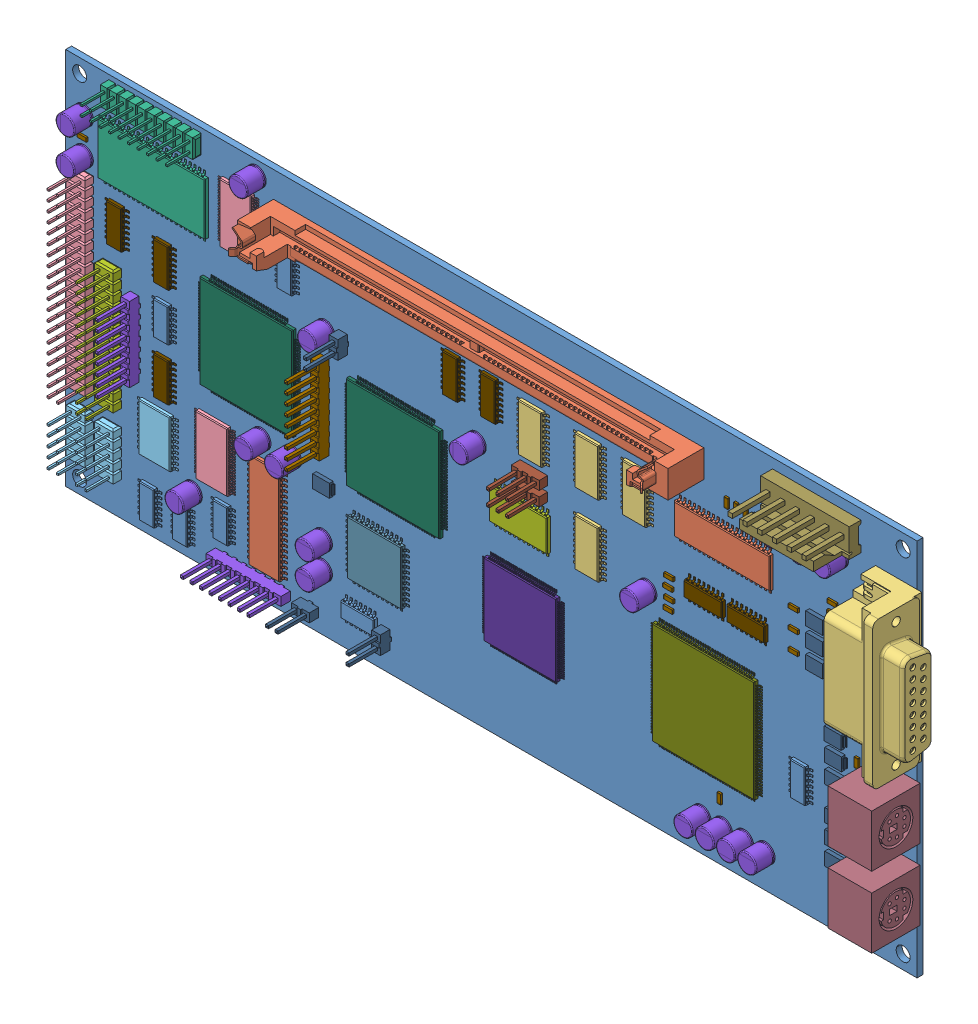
SolidWorks assembly PCB 1.SLDASM, configuration Default (file format 4894). Lengths in mm.
Overall size (236.17 101.6 18.68).
105 component instances, 28 part files, 0 mates.
Components (placement in the parent):
- PCB-1: PCB.SLDPRT [Default] at origin size (228.6 101.6 1.6)
- C-5822031-04-3-1: C-5822031-04-3.SLDPRT [Default] at (113.5832 90.9786 6.3625) x (-1 0 0) z (0 1 0) size (115.57 18.67 8.51)
- C-1634585-22-3-1: C-1634585-22-3.SLDPRT [Default] at (236.1713 70.6819 8.9) x (0 1 0) z (1 0 0) size (39.3 17.38 20.88)
- 010897401-1: 010897401.SLDPRT [Default] at (4.8996 50.8025 2.743) x (0 -1 0) z (-1 0 0) size (50.8 11.1 5.08)
- 010897101-1: 010897101.SLDPRT [Default] at (4.8996 15.2109 2.743) x (0 -1 0) z (-1 0 0) size (12.7 11.1 5.08)
- 010897101-2: 010897101.SLDPRT [Default] at (12.527 15.2109 2.743) x (0 -1 0) z (-1 0 0) size (12.7 11.1 5.08)
- 010897201-1: 010897201.SLDPRT [Default] at (23.9828 97.8273 2.743) x (1 0 0) z (0 -1 0) size (25.4 11.1 5.08)
- 010897261-1: 010897261.SLDPRT [Default] at (12.527 41.9125 2.743) x (0 1 0) z (1 0 0) size (33.02 11.1 5.08)
- 22-03-2081-1: 22-03-2081.SLDPRT [Default] at (18.8889 44.4468 3.251) x (0 -1 0) z (-1 0 0) size (20.07 14.22 2.34)
- 22-03-2081-2: 22-03-2081.SLDPRT [Default] at (50.6628 5.0372 3.251) x (1 0 0) z (0 -1 0) size (20.07 14.22 2.34)
- 22-03-2091-1: 22-03-2091.SLDPRT [Default] at (69.6814 53.9524 3.0592) x (0 -1 0) z (-0.999901 0 -0.014072) size (22.61 14.22 2.34)
- 22-03-2021-1: 22-03-2021.SLDPRT [Default] at (65.9177 5.0372 3.251) x (1 0 0) z (0 -1 0) size (4.83 14.22 2.34)
- 22-03-2021-2: 22-03-2021.SLDPRT [Default] at (86.2603 8.2152 3.251) x (0 1 0) z (1 0 0) size (4.83 14.22 2.34)
- 22-03-2021-3: 22-03-2021.SLDPRT [Default] at (74.8312 71.1344 3.251) x (0 1 0) z (1 0 0) size (4.83 14.22 2.34)
- 22-03-2031-1: 22-03-2031.SLDPRT [Default] at (125.7326 66.0588 2.6741) x (0.999825 0 -0.018693) z (0 -1 0) size (7.37 14.22 2.34)
- 22-03-2031-2: 22-03-2031.SLDPRT [Default] at (125.7328 62.233 2.681) x (0.999825 0 -0.018693) z (0 -1 0) size (7.37 14.22 2.34)
- C-0640445-06-3-1: C-0640445-06-3.SLDPRT [Default] at (201.6604 95.148 4.775) x (-1 0 0) z (0 0 1) size (23.77 7.62 16.51)
- MDN-S-06-F-S-1: MDN-S-06-F-S.SLDPRT [Default] at (223.0263 38.7131 8.1) x (0 1 0) z (1 0 0) size (14 16.5 13.39)
- MDN-S-06-F-S-2: MDN-S-06-F-S.SLDPRT [Default] at (223.0263 19.6533 8.1) x (0 1 0) z (1 0 0) size (14 16.5 13.39)
- 44 PIN IC PACKAGE-1: 44 PIN IC PACKAGE.SLDPRT [Default] at (83.8676 24.6721 2.16) x (0 -1 0) z (-1 0 0) size (16.9 1.06 16.9)
- 132 PIN IC PACKAGE-1: 132 PIN IC PACKAGE.SLDPRT [Default] at (49.4249 55.1701 2.16) x (1 0 0) z (0 -1 0) size (27.4 1.06 27.4)
- 132 PIN IC PACKAGE-2: 132 PIN IC PACKAGE.SLDPRT [Default] at (88.8256 51.3458 2.16) x (1 0 0) z (0 -1 0) size (27.4 1.06 27.4)
- 160 PIN IC PACKAGE-3: 160 PIN IC PACKAGE.SLDPRT [Default] at (172.1985 33.8975 2.16) x (1 0 0) z (0 -1 0) size (29.9 1.06 29.9)
- 144 PIN IC PACKAGE-4: 144 PIN IC PACKAGE.SLDPRT [Default] at (123.0123 30.7037 2.16) x (1 0 0) z (0 -1 0) size (21.9 1.06 21.9)
- 16 PIN IC PACKAGE-2: 16 PIN IC PACKAGE.SLDPRT [Default] at (26.5201 38.0085 2.16) x (1 0 0) z (0 -1 0) size (6.4 1.06 10.23)
- 16 PIN IC PACKAGE-3: 16 PIN IC PACKAGE.SLDPRT [Default] at (26.5201 65.9634 2.16) x (-1 0 0) z (0 1 0) size (6.4 1.06 10.23)
- 16 PIN IC PACKAGE-4: 16 PIN IC PACKAGE.SLDPRT [Default] at (13.9137 67.2504 2.16) x (1 0 0) z (0 -1 0) size (6.4 1.06 10.23)
- 16 PIN IC PACKAGE-5: 16 PIN IC PACKAGE.SLDPRT [Default] at (114.2542 77.4062 2.16) x (1 0 0) z (0 -1 0) size (6.4 1.06 10.23)
- 16 PIN IC PACKAGE-6: 16 PIN IC PACKAGE.SLDPRT [Default] at (104.0492 77.4062 2.16) x (1 0 0) z (0 -1 0) size (6.4 1.06 10.23)
- 16 PIN IC PACKAGE-7: 16 PIN IC PACKAGE.SLDPRT [Default] at (171.4199 60.231 2.16) x (0 -1 0) z (-1 0 0) size (6.4 1.06 10.23)
- 16 PIN IC PACKAGE-8: 16 PIN IC PACKAGE.SLDPRT [Default] at (182.8729 60.231 2.16) x (0 -1 0) z (-1 0 0) size (6.4 1.06 10.23)
- 14 PIN IC PACKAGE-2: 14 PIN IC PACKAGE.SLDPRT [Default] at (22.6917 7.5171 2.16) x (1 0 0) z (0 -1 0) size (6.4 1.06 9)
- 14 PIN IC PACKAGE-3: 14 PIN IC PACKAGE.SLDPRT [Default] at (31.5884 7.5171 2.16) x (1 0 0) z (0 -1 0) size (6.4 1.06 9)
- 14 PIN IC PACKAGE-4: 14 PIN IC PACKAGE.SLDPRT [Default] at (42.3976 13.2352 2.16) x (1 0 0) z (0 -1 0) size (6.4 1.06 9)
- 14 PIN IC PACKAGE-5: 14 PIN IC PACKAGE.SLDPRT [Default] at (26.5201 52.0013 2.16) x (-1 0 0) z (0 1 0) size (6.4 1.06 9)
- 14 PIN IC PACKAGE-6: 14 PIN IC PACKAGE.SLDPRT [Default] at (79.2986 9.3193 2.16) x (0 -1 0) z (-1 0 0) size (6.4 1.06 9)
- 14 PIN IC PACKAGE-7: 14 PIN IC PACKAGE.SLDPRT [Default] at (59.5786 79.9567 2.16) x (1 0 0) z (0 -1 0) size (6.4 1.06 9)
- 14 PIN IC PACKAGE-8: 14 PIN IC PACKAGE.SLDPRT [Default] at (197.4785 30.3746 2.16) x (-1 0 0) z (0 1 0) size (6.4 1.06 9)
- 40 PIN IC PACKAGE-1: 40 PIN IC PACKAGE.SLDPRT [Default] at (54.2284 19.5817 2.16) x (1 0 0) z (0 -1 0) size (10.65 1.06 25.73)
- 20 PIN IC PACKAGE-3: 20 PIN IC PACKAGE.SLDPRT [Default] at (125.5728 74.863 2.16) x (1 0 0) z (0 -1 0) size (8.7 1.06 12.73)
- 20 PIN IC PACKAGE-4: 20 PIN IC PACKAGE.SLDPRT [Default] at (153.5178 76.133 2.16) x (-1 0 0) z (0 1 0) size (8.7 1.06 12.73)
- 20 PIN IC PACKAGE-5: 20 PIN IC PACKAGE.SLDPRT [Default] at (140.8131 55.8084 2.16) x (1 0 0) z (0 -1 0) size (8.7 1.06 12.73)
- 20 PIN IC PACKAGE-6: 20 PIN IC PACKAGE.SLDPRT [Default] at (140.8247 76.133 2.16) x (-1 0 0) z (0 1 0) size (8.7 1.06 12.73)
- 48 PIN IC PACKAGE-1: 48 PIN IC PACKAGE.SLDPRT [Default] at (40.1414 27.837 2.16) x (1 0 0) z (0 -1 0) size (10.9 1.06 15.87)
- 48 PIN IC PACKAGE-2: 48 PIN IC PACKAGE.SLDPRT [Default] at (46.5188 85.025 2.16) x (1 0 0) z (0 -1 0) size (10.9 1.06 15.87)
- 20 PIN IC PACKAGE WIDE-2: 20 PIN IC PACKAGE WIDE.SLDPRT [Default] at (24.7941 24.0301 2.16) x (1 0 0) z (0 -1 0) size (10.9 1.06 12.73)
- 40 PIN IC PACKAGE-2: 40 PIN IC PACKAGE.SLDPRT [Default] at (176.536 75.1992 2.16) x (0 -1 0) z (-1 0 0) size (10.65 1.06 25.73)
- 44 PIN IC PACKAGE WIDE-3: 44 PIN IC PACKAGE WIDE.SLDPRT [Default] at (23.3745 84.0191 2.16) x (0 -1 0) z (-1 0 0) size (16.4 1.06 28.73)
- 24 PIN IC PACKAGE-7: 24 PIN IC PACKAGE.SLDPRT [Default] at (123.129 54.0125 2.16) x (0 1 0) z (1 0 0) size (10.9 1.06 15.48)
- CAP-1: CAP.SLDPRT [Default] at (110.3893 65.4238 1.6) x (1 0 0) z (0 -1 0) size (5.08 8.08 5.08)
- CAP-2: CAP.SLDPRT [Default] at (69.7503 71.1249 1.6) x (0 1 0) z (1 0 0) size (5.08 8.08 5.08)
- CAP-3: CAP.SLDPRT [Default] at (51.3019 97.8073 1.6) x (0 -1 0) z (-1 0 0) size (5.08 8.08 5.08)
- CAP-4: CAP.SLDPRT [Default] at (4.9297 88.9128 1.6) x (1 0 0) z (0 -1 0) size (5.08 8.08 5.08)
- CAP-5: CAP.SLDPRT [Default] at (4.9024 79.3831 1.6) x (1 0 0) z (0 -1 0) size (5.08 8.08 5.08)
- CAP-6: CAP.SLDPRT [Default] at (34.1543 15.8348 1.6) x (-1 0 0) z (0 1 0) size (5.08 8.08 5.08)
- CAP-7: CAP.SLDPRT [Default] at (52.6017 37.4359 1.6) x (0 -1 0) z (-1 0 0) size (5.08 8.08 5.08)
- CAP-8: CAP.SLDPRT [Default] at (60.8466 37.4478 1.6) x (0 1 0) z (1 0 0) size (5.08 8.08 5.08)
- CAP-9: CAP.SLDPRT [Default] at (69.097 22.1985 1.6) x (0 -1 0) z (-1 0 0) size (5.08 8.08 5.08)
- CAP-10: CAP.SLDPRT [Default] at (69.097 15.2003 1.6) x (0 -1 0) z (-1 0 0) size (5.08 8.08 5.08)
- CAP-11: CAP.SLDPRT [Default] at (156.2027 53.9923 1.6) x (0 -1 0) z (-1 0 0) size (5.08 8.08 5.08)
- CAP-12: CAP.SLDPRT [Default] at (193.6607 87.6833 1.6) x (0 1 0) z (1 0 0) size (5.08 8.08 5.08)
- CAP-13: CAP.SLDPRT [Default] at (201.2781 87.6833 1.6) x (0 -1 0) z (-1 0 0) size (5.08 8.08 5.08)
- CAP-14: CAP.SLDPRT [Default] at (207.6562 87.6833 1.6) x (0 -1 0) z (-1 0 0) size (5.08 8.08 5.08)
- CAP-15: CAP.SLDPRT [Default] at (170.7852 8.8328 1.6) x (0 -1 0) z (-1 0 0) size (5.08 8.08 5.08)
- CAP-16: CAP.SLDPRT [Default] at (176.5151 8.8328 1.6) x (0 -1 0) z (-1 0 0) size (5.08 8.08 5.08)
- CAP-17: CAP.SLDPRT [Default] at (182.211 8.8328 1.6) x (0 1 0) z (1 0 0) size (5.08 8.08 5.08)
- CAP-18: CAP.SLDPRT [Default] at (187.9302 8.8328 1.6) x (0 -1 0) z (-1 0 0) size (5.08 8.08 5.08)
- RES-1: RES.SLDPRT [Default] at (177.7908 85.2573 1.6) x (1 0 0) z (0 -1 0) size (1 0.5 2.54)
- RES-2: RES.SLDPRT [Default] at (180.3077 85.2573 1.6) x (1 0 0) z (0 -1 0) size (1 0.5 2.54)
- RES-3: RES.SLDPRT [Default] at (182.8828 85.2573 1.6) x (1 0 0) z (0 -1 0) size (1 0.5 2.54)
- RES-4: RES.SLDPRT [Default] at (185.4111 85.2573 1.6) x (1 0 0) z (0 -1 0) size (1 0.5 2.54)
- RES-5: RES.SLDPRT [Default] at (207.6562 69.5385 1.6) x (1 0 0) z (0 -1 0) size (1 0.5 2.54)
- RES-6: RES.SLDPRT [Default] at (207.6562 64.5002 1.6) x (1 0 0) z (0 -1 0) size (1 0.5 2.54)
- RES-7: RES.SLDPRT [Default] at (207.6562 59.3911 1.6) x (1 0 0) z (0 -1 0) size (1 0.5 2.54)
- RES-8: RES.SLDPRT [Default] at (212.7309 42.2506 1.6) x (1 0 0) z (0 -1 0) size (1 0.5 2.54)
- RES-9: RES.SLDPRT [Default] at (212.7309 36.8897 1.6) x (1 0 0) z (0 -1 0) size (1 0.5 2.54)
- RES-10: RES.SLDPRT [Default] at (212.7309 32.0869 1.6) x (1 0 0) z (0 -1 0) size (1 0.5 2.54)
- RES-11: RES.SLDPRT [Default] at (212.7309 23.1851 1.6) x (1 0 0) z (0 -1 0) size (1 0.5 2.54)
- RES-12: RES.SLDPRT [Default] at (212.7309 17.8609 1.6) x (1 0 0) z (0 -1 0) size (1 0.5 2.54)
- RES-13: RES.SLDPRT [Default] at (212.7309 12.98 1.6) x (1 0 0) z (0 -1 0) size (1 0.5 2.54)
- RES-14: RES.SLDPRT [Default] at (175.8821 15.5876 1.6) x (1 0 0) z (0 -1 0) size (1 0.5 2.54)
- RES-15: RES.SLDPRT [Default] at (206.165 76.1321 1.6) x (0 -1 0) z (-1 0 0) size (1 0.5 2.54)
- RES-16: RES.SLDPRT [Default] at (210.6395 76.1283 1.6) x (0 -1 0) z (-1 0 0) size (1 0.5 2.54)
- RES-17: RES.SLDPRT [Default] at (210.6111 73.5923 1.6) x (0 -1 0) z (-1 0 0) size (1 0.5 2.54)
- RES-18: RES.SLDPRT [Default] at (206.1039 73.5856 1.6) x (0 -1 0) z (-1 0 0) size (1 0.5 2.54)
- RES-19: RES.SLDPRT [Default] at (195.7767 69.7732 1.6) x (0 -1 0) z (-1 0 0) size (1 0.5 2.54)
- RES-20: RES.SLDPRT [Default] at (195.7767 64.7271 1.6) x (0 -1 0) z (-1 0 0) size (1 0.5 2.54)
- RES-21: RES.SLDPRT [Default] at (195.7767 59.6447 1.6) x (0 -1 0) z (-1 0 0) size (1 0.5 2.54)
- RES-22: RES.SLDPRT [Default] at (162.3018 60.2695 1.6) x (0 -1 0) z (-1 0 0) size (1 0.5 2.54)
- RES-23: RES.SLDPRT [Default] at (162.0788 57.731 1.6) x (0 -1 0) z (-1 0 0) size (1 0.5 2.54)
- RES-24: RES.SLDPRT [Default] at (162.3136 55.1258 1.6) x (0 -1 0) z (-1 0 0) size (1 0.5 2.54)
- RES-25: RES.SLDPRT [Default] at (162.1023 52.6293 1.6) x (0 -1 0) z (-1 0 0) size (1 0.5 2.54)
- RES-27: RES.SLDPRT [Default] at (4.7592 83.7576 1.6) x (0 1 0) z (1 0 0) size (1 0.5 2.54)
- RES-28: RES.SLDPRT [Default] at (223.0642 8.7702 1.6) x (0 -1 0) z (-1 0 0) size (1 0.5 2.54)
- RES-29: RES.SLDPRT [Default] at (223.0978 48.8311 1.6) x (0 1 0) z (1 0 0) size (1 0.5 2.54)
- SMDIODE-1: SMDIODE.SLDPRT [Default] at (69.6346 35.428 2.16) x (1 0 0) z (0 -1 0) size (5.5 1.06 3.5)
- SMDIODE-2: SMDIODE.SLDPRT [Default] at (207.1119 16.4143 2.16) x (1 0 0) z (0 -1 0) size (5.5 1.06 3.5)
- SMDIODE-3: SMDIODE.SLDPRT [Default] at (207.1119 21.4836 2.16) x (-1 0 0) z (0 1 0) size (5.5 1.06 3.5)
- SMDIODE-4: SMDIODE.SLDPRT [Default] at (207.1119 26.564 2.16) x (1 0 0) z (0 -1 0) size (5.5 1.06 3.5)
- SMDIODE-5: SMDIODE.SLDPRT [Default] at (207.1119 45.6003 2.2877) x (1 0 0) z (0 -1 0) size (5.5 1.06 3.5)
- SMDIODE-6: SMDIODE.SLDPRT [Default] at (207.1119 40.5473 2.16) x (1 0 0) z (0 -1 0) size (5.5 1.06 3.5)
- SMDIODE-7: SMDIODE.SLDPRT [Default] at (207.1119 35.473 2.16) x (1 0 0) z (0 -1 0) size (5.5 1.06 3.5)
- SMDIODE-8: SMDIODE.SLDPRT [Default] at (201.9979 59.6082 2.16) x (1 0 0) z (0 -1 0) size (5.5 1.06 3.5)
- SMDIODE-9: SMDIODE.SLDPRT [Default] at (201.9979 64.7181 2.16) x (-1 0 0) z (0 1 0) size (5.5 1.06 3.5)
- SMDIODE-10: SMDIODE.SLDPRT [Default] at (201.9979 69.7443 2.16) x (1 0 0) z (0 -1 0) size (5.5 1.06 3.5)
